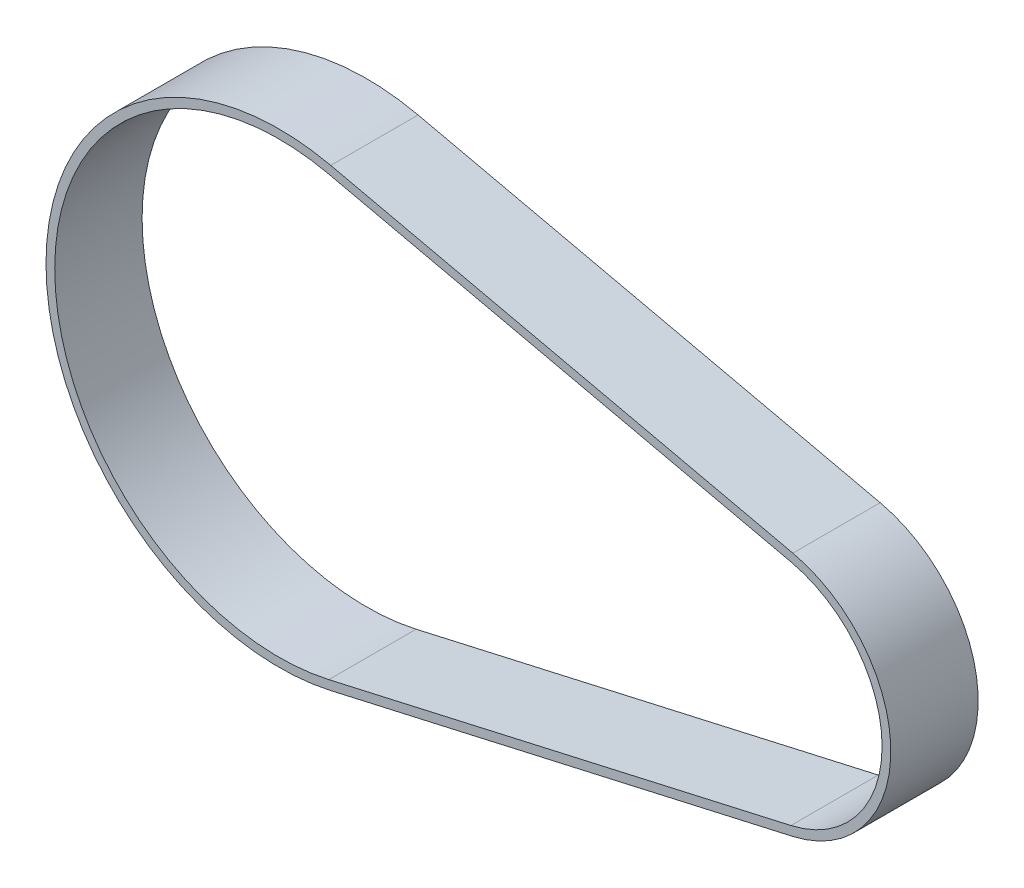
from build123d import *

# Parameters (mm, degrees)
BOSS_EXTRUDE1_DEPTH = 10


with BuildPart() as part:
    # Sketch1 → Boss-Extrude1 (new body)
    with BuildSketch(Plane.XY.offset(10)):
        with BuildLine():
            Line((5.900674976, -26.032644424), (58.799239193, -14.04242057))
            ThreePointArc((58.799239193, -14.04242057), (70.014951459, 0), (58.799239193, 14.04242057))
            Line((58.799239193, 14.04242057), (5.900674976, 26.032644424))
            ThreePointArc((5.900674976, 26.032644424), (-26.693005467, 0), (5.900674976, -26.032644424))
        make_face()
        with BuildLine():
            Line((5.679618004, 25.057383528), (58.578182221, 13.067159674))
            ThreePointArc((58.578182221, 13.067159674), (69.014951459, 0), (58.578182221, -13.067159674))
            Line((58.578182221, -13.067159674), (5.679618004, -25.057383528))
            ThreePointArc((5.679618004, -25.057383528), (-25.693005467, 0), (5.679618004, 25.057383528))
        make_face(mode=Mode.SUBTRACT)
    extrude(amount=-BOSS_EXTRUDE1_DEPTH)


solid = part.part
